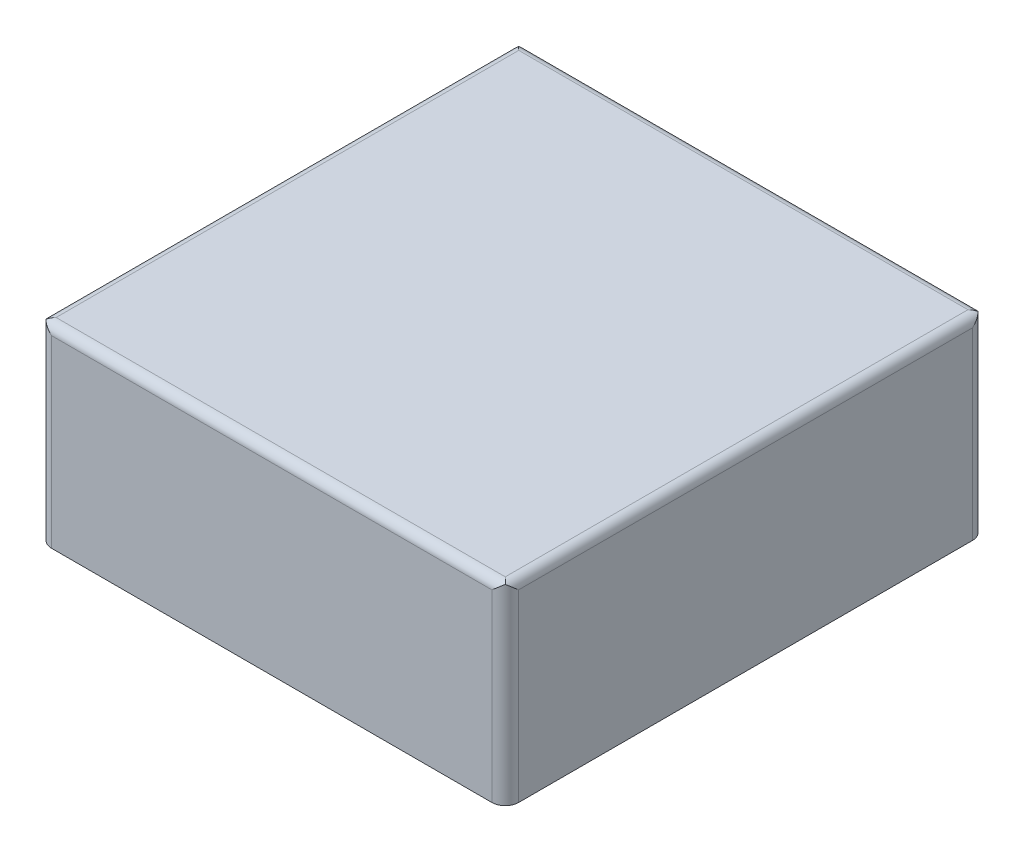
ISO-10303-21;
HEADER;
FILE_DESCRIPTION(('STEP AP214'),'2;1');
FILE_NAME('part.step','',(''),(''),'','','');
FILE_SCHEMA(('AUTOMOTIVE_DESIGN { 1 0 10303 214 1 1 1 1 }'));
ENDSEC;
DATA;
#1=APPLICATION_CONTEXT('core data for automotive mechanical design processes');
#2=APPLICATION_PROTOCOL_DEFINITION('international standard','automotive_design',2000,#1);
#3=PRODUCT_CONTEXT('',#1,'mechanical');
#4=PRODUCT('Part','Part','',(#3));
#5=PRODUCT_RELATED_PRODUCT_CATEGORY('part','',(#4));
#6=PRODUCT_DEFINITION_FORMATION('','',#4);
#7=PRODUCT_DEFINITION_CONTEXT('part definition',#1,'design');
#8=PRODUCT_DEFINITION('design','',#6,#7);
#9=PRODUCT_DEFINITION_SHAPE('','',#8);
#10=(LENGTH_UNIT() NAMED_UNIT(*) SI_UNIT(.MILLI.,.METRE.));
#11=(NAMED_UNIT(*) PLANE_ANGLE_UNIT() SI_UNIT($,.RADIAN.));
#12=(NAMED_UNIT(*) SI_UNIT($,.STERADIAN.) SOLID_ANGLE_UNIT());
#13=UNCERTAINTY_MEASURE_WITH_UNIT(LENGTH_MEASURE(1.E-05),#10,'distance_accuracy_value','');
#14=(GEOMETRIC_REPRESENTATION_CONTEXT(3) GLOBAL_UNCERTAINTY_ASSIGNED_CONTEXT((#13)) GLOBAL_UNIT_ASSIGNED_CONTEXT((#10,
#11,#12)) REPRESENTATION_CONTEXT('',''));
#15=CARTESIAN_POINT('',(0.,0.,0.));
#16=DIRECTION('',(0.,0.,1.));
#17=DIRECTION('',(1.,0.,0.));
#18=AXIS2_PLACEMENT_3D('',#15,#16,#17);
#19=CARTESIAN_POINT('',(611.,-109.,-14.4));
#20=DIRECTION('',(0.,-1.,0.));
#21=DIRECTION('',(0.,0.,-1.));
#22=AXIS2_PLACEMENT_3D('',#19,#20,#21);
#23=PLANE('',#22);
#24=DIRECTION('',(0.,0.,-1.));
#25=VECTOR('',#24,1.);
#26=CARTESIAN_POINT('',(561.,-109.,39.1));
#27=LINE('',#26,#25);
#28=CARTESIAN_POINT('',(561.,-109.,-65.9));
#29=VERTEX_POINT('',#28);
#30=CARTESIAN_POINT('',(561.,-108.999999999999,37.1));
#31=VERTEX_POINT('',#30);
#32=EDGE_CURVE('E135',#29,#31,#27,.F.);
#33=ORIENTED_EDGE('',*,*,#32,.T.);
#34=DIRECTION('',(-1.,0.,0.));
#35=VECTOR('',#34,1.);
#36=CARTESIAN_POINT('',(663.,-109.,37.0999999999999));
#37=LINE('',#36,#35);
#38=CARTESIAN_POINT('',(661.,-109.,37.0999999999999));
#39=VERTEX_POINT('',#38);
#40=EDGE_CURVE('E225',#31,#39,#37,.F.);
#41=ORIENTED_EDGE('',*,*,#40,.T.);
#42=DIRECTION('',(0.,0.,-1.));
#43=VECTOR('',#42,1.);
#44=CARTESIAN_POINT('',(661.,-109.,39.0999999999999));
#45=LINE('',#44,#43);
#46=CARTESIAN_POINT('',(661.,-109.,-65.9));
#47=VERTEX_POINT('',#46);
#48=EDGE_CURVE('E138',#39,#47,#45,.T.);
#49=ORIENTED_EDGE('',*,*,#48,.T.);
#50=DIRECTION('',(-1.,0.,0.));
#51=VECTOR('',#50,1.);
#52=CARTESIAN_POINT('',(663.,-109.,-65.9));
#53=LINE('',#52,#51);
#54=EDGE_CURVE('E133',#47,#29,#53,.T.);
#55=ORIENTED_EDGE('',*,*,#54,.T.);
#56=EDGE_LOOP('',(#33,#41,#49,#55));
#57=FACE_BOUND('',#56,.T.);
#58=ADVANCED_FACE('F16',(#57),#23,.F.);
#59=CARTESIAN_POINT('',(561.,-111.,38.8527761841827));
#60=DIRECTION('',(0.,0.,-1.));
#61=DIRECTION('',(-1.,0.,0.));
#62=AXIS2_PLACEMENT_3D('',#59,#60,#61);
#63=CYLINDRICAL_SURFACE('',#62,2.);
#64=CARTESIAN_POINT('',(559.,-111.,-64.9));
#65=CARTESIAN_POINT('',(559.000002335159,-110.938544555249,-64.9753303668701));
#66=CARTESIAN_POINT('',(559.002836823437,-110.877098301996,-65.0506711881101));
#67=CARTESIAN_POINT('',(559.013154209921,-110.765713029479,-65.1873102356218));
#68=CARTESIAN_POINT('',(559.019688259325,-110.715732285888,-65.2486473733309));
#69=CARTESIAN_POINT('',(559.034666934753,-110.627269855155,-65.3572680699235));
#70=CARTESIAN_POINT('',(559.042351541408,-110.588729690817,-65.4046102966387));
#71=CARTESIAN_POINT('',(559.064031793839,-110.494711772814,-65.5204448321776));
#72=CARTESIAN_POINT('',(559.07931098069,-110.439425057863,-65.5888575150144));
#73=CARTESIAN_POINT('',(559.113419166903,-110.334026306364,-65.7196673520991));
#74=CARTESIAN_POINT('',(559.131871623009,-110.283850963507,-65.7821121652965));
#75=CARTESIAN_POINT('',(559.171297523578,-110.188700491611,-65.9010101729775));
#76=CARTESIAN_POINT('',(559.191919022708,-110.143648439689,-65.9575179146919));
#77=CARTESIAN_POINT('',(559.228129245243,-110.071891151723,-66.0480865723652));
#78=CARTESIAN_POINT('',(559.242564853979,-110.04485177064,-66.0823472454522));
#79=CARTESIAN_POINT('',(559.272461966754,-109.991886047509,-66.1497444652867));
#80=CARTESIAN_POINT('',(559.287888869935,-109.965948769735,-66.1828877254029));
#81=CARTESIAN_POINT('',(559.319684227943,-109.915185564,-66.2480309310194));
#82=CARTESIAN_POINT('',(559.33601871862,-109.890348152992,-66.2800385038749));
#83=CARTESIAN_POINT('',(559.369548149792,-109.84178588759,-66.3428994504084));
#84=CARTESIAN_POINT('',(559.386709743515,-109.818048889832,-66.373761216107));
#85=CARTESIAN_POINT('',(559.421813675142,-109.771687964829,-66.4343231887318));
#86=CARTESIAN_POINT('',(559.439723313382,-109.749051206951,-66.4640325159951));
#87=CARTESIAN_POINT('',(559.47624571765,-109.704891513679,-66.5222866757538));
#88=CARTESIAN_POINT('',(559.494826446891,-109.683355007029,-66.5508412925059));
#89=CARTESIAN_POINT('',(559.532615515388,-109.641396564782,-66.6067869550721));
#90=CARTESIAN_POINT('',(559.551792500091,-109.620960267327,-66.6341883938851));
#91=CARTESIAN_POINT('',(559.59070081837,-109.58120307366,-66.6878322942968));
#92=CARTESIAN_POINT('',(559.610401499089,-109.561866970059,-66.7140857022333));
#93=CARTESIAN_POINT('',(559.65028629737,-109.524310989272,-66.7654415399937));
#94=CARTESIAN_POINT('',(559.670440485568,-109.506075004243,-66.7905554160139));
#95=CARTESIAN_POINT('',(559.711163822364,-109.470720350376,-66.8396432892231));
#96=CARTESIAN_POINT('',(559.731703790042,-109.453584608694,-66.8636291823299));
#97=CARTESIAN_POINT('',(559.773132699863,-109.420430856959,-66.910475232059));
#98=CARTESIAN_POINT('',(559.79399323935,-109.404394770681,-66.93334768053));
#99=CARTESIAN_POINT('',(559.835999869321,-109.373443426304,-66.9779830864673));
#100=CARTESIAN_POINT('',(559.857118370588,-109.358508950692,-66.9997587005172));
#101=CARTESIAN_POINT('',(559.87867965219,-109.343908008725,-67.0213203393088));
#102=B_SPLINE_CURVE_WITH_KNOTS('',3,(#64,#65,#66,#67,#68,#69,#70,#71,#72,#73,#74,#75,#76,#77,
#78,#79,#80,#81,#82,#83,#84,#85,#86,#87,#88,#89,#90,#91,#92,#93,#94,#95,#96,#97,#98,#99,#100,
#101),.UNSPECIFIED.,.F.,.F.,(4,2,2,2,2,2,2,2,2,2,2,2,2,2,2,2,2,2,4),(0.,0.291614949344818,
0.529696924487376,0.714242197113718,0.981921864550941,1.22842115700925,1.45377929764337,
1.59166995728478,1.72611877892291,1.85714512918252,1.98476993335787,2.10901583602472,
2.22990738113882,2.34747121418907,2.46173630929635,2.57273422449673,2.68049938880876,
2.78506942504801,2.88648551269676),.UNSPECIFIED.);
#103=CARTESIAN_POINT('',(559.,-111.,-64.9));
#104=VERTEX_POINT('',#103);
#105=CARTESIAN_POINT('',(559.878679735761,-109.343907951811,-67.0213202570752));
#106=VERTEX_POINT('',#105);
#107=EDGE_CURVE('E485',#104,#106,#102,.T.);
#108=ORIENTED_EDGE('',*,*,#107,.F.);
#109=DIRECTION('',(0.,0.,1.));
#110=VECTOR('',#109,1.);
#111=CARTESIAN_POINT('',(559.,-111.,-15.9));
#112=LINE('',#111,#110);
#113=CARTESIAN_POINT('',(559.,-111.,36.1));
#114=VERTEX_POINT('',#113);
#115=EDGE_CURVE('E409',#114,#104,#112,.F.);
#116=ORIENTED_EDGE('',*,*,#115,.F.);
#117=CARTESIAN_POINT('',(559.87867965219,-109.343908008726,38.2213203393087));
#118=CARTESIAN_POINT('',(559.857119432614,-109.358508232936,38.1997597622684));
#119=CARTESIAN_POINT('',(559.8360019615,-109.373441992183,38.1779852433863));
#120=CARTESIAN_POINT('',(559.793997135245,-109.404392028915,38.1333518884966));
#121=CARTESIAN_POINT('',(559.773137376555,-109.420427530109,38.1104803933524));
#122=CARTESIAN_POINT('',(559.731709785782,-109.453580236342,38.0636360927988));
#123=CARTESIAN_POINT('',(559.711170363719,-109.470715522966,38.0396509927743));
#124=CARTESIAN_POINT('',(559.670447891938,-109.50606939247,37.990564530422));
#125=CARTESIAN_POINT('',(559.650294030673,-109.524305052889,37.9654512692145));
#126=CARTESIAN_POINT('',(559.610409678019,-109.561860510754,37.9140964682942));
#127=CARTESIAN_POINT('',(559.590709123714,-109.581196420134,37.8878434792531));
#128=CARTESIAN_POINT('',(559.551800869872,-109.620953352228,37.8342002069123));
#129=CARTESIAN_POINT('',(559.532623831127,-109.641389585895,37.8067989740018));
#130=CARTESIAN_POINT('',(559.494834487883,-109.683348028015,37.7508534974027));
#131=CARTESIAN_POINT('',(559.476253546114,-109.704884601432,37.7222988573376));
#132=CARTESIAN_POINT('',(559.439730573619,-109.749044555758,37.6640444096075));
#133=CARTESIAN_POINT('',(559.421820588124,-109.771681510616,37.6343348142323));
#134=CARTESIAN_POINT('',(559.386715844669,-109.818042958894,37.5737720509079));
#135=CARTESIAN_POINT('',(559.369553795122,-109.841780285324,37.5429097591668));
#136=CARTESIAN_POINT('',(559.33602336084,-109.890343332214,37.4800474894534));
#137=CARTESIAN_POINT('',(559.319688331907,-109.915181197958,37.4480391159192));
#138=CARTESIAN_POINT('',(559.287891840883,-109.965945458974,37.3828940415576));
#139=CARTESIAN_POINT('',(559.272464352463,-109.991883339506,37.349749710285));
#140=CARTESIAN_POINT('',(559.24256602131,-110.044850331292,37.2823500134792));
#141=CARTESIAN_POINT('',(559.228129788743,-110.071890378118,37.2480879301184));
#142=CARTESIAN_POINT('',(559.191923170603,-110.143639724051,37.1575282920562));
#143=CARTESIAN_POINT('',(559.171305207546,-110.188683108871,37.1010312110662));
#144=CARTESIAN_POINT('',(559.1318814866,-110.283824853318,36.9821442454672));
#145=CARTESIAN_POINT('',(559.1134283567,-110.334000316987,36.9196997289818));
#146=CARTESIAN_POINT('',(559.079315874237,-110.439407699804,36.788879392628));
#147=CARTESIAN_POINT('',(559.064033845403,-110.494703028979,36.72045578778));
#148=CARTESIAN_POINT('',(559.042352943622,-110.588723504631,36.604617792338));
#149=CARTESIAN_POINT('',(559.034669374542,-110.627257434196,36.5572830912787));
#150=CARTESIAN_POINT('',(559.019690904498,-110.71571359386,36.4486699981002));
#151=CARTESIAN_POINT('',(559.01315639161,-110.765694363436,36.3873329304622));
#152=CARTESIAN_POINT('',(559.002837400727,-110.877085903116,36.2506864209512));
#153=CARTESIAN_POINT('',(559.000002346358,-110.938538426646,36.1753380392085));
#154=CARTESIAN_POINT('',(559.,-111.,36.1));
#155=B_SPLINE_CURVE_WITH_KNOTS('',3,(#117,#118,#119,#120,#121,#122,#123,#124,#125,#126,#127,
#128,#129,#130,#131,#132,#133,#134,#135,#136,#137,#138,#139,#140,#141,#142,#143,#144,#145,#146,
#147,#148,#149,#150,#151,#152,#153,#154),.UNSPECIFIED.,.F.,.F.,(4,2,2,2,2,2,2,2,2,2,2,2,2,2,2,2,
2,2,4),(0.,0.101411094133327,0.205977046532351,0.313739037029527,0.424734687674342,
0.538998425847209,0.656561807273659,0.777453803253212,0.901701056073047,1.02932810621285,
1.16035759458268,1.29481044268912,1.43270601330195,1.65802165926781,1.90452095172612,
2.1722431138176,2.35675893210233,2.59484090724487,2.88648530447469),.UNSPECIFIED.);
#156=CARTESIAN_POINT('',(559.878679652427,-109.343908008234,38.2213203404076));
#157=VERTEX_POINT('',#156);
#158=EDGE_CURVE('E410',#157,#114,#155,.T.);
#159=ORIENTED_EDGE('',*,*,#158,.F.);
#160=CARTESIAN_POINT('',(559.878679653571,-109.343908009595,38.2213203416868));
#161=CARTESIAN_POINT('',(559.903850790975,-109.326866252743,38.1961460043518));
#162=CARTESIAN_POINT('',(559.929244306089,-109.310508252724,38.1707346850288));
#163=CARTESIAN_POINT('',(559.981728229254,-109.278338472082,38.118206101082));
#164=CARTESIAN_POINT('',(560.008839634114,-109.262595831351,38.0910674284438));
#165=CARTESIAN_POINT('',(560.064781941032,-109.231827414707,38.0350855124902));
#166=CARTESIAN_POINT('',(560.093632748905,-109.216872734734,38.0062231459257));
#167=CARTESIAN_POINT('',(560.153062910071,-109.187862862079,37.9467899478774));
#168=CARTESIAN_POINT('',(560.183660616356,-109.173880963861,37.9162017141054));
#169=CARTESIAN_POINT('',(560.246583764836,-109.147006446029,37.8533191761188));
#170=CARTESIAN_POINT('',(560.278925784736,-109.134189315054,37.8210092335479));
#171=CARTESIAN_POINT('',(560.345305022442,-109.109847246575,37.7546665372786));
#172=CARTESIAN_POINT('',(560.379355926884,-109.098400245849,37.7206188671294));
#173=CARTESIAN_POINT('',(560.440438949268,-109.079666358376,37.6595808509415));
#174=CARTESIAN_POINT('',(560.467411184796,-109.072013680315,37.6326419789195));
#175=CARTESIAN_POINT('',(560.521268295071,-109.057943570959,37.5788941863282));
#176=CARTESIAN_POINT('',(560.548151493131,-109.05151491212,37.5520865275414));
#177=CARTESIAN_POINT('',(560.601777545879,-109.03985624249,37.4986063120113));
#178=CARTESIAN_POINT('',(560.628519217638,-109.034615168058,37.4719349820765));
#179=CARTESIAN_POINT('',(560.680272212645,-109.025558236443,37.4201472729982));
#180=CARTESIAN_POINT('',(560.705282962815,-109.021671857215,37.3950425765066));
#181=CARTESIAN_POINT('',(560.768523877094,-109.013067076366,37.3316080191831));
#182=CARTESIAN_POINT('',(560.806809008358,-109.008980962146,37.2932460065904));
#183=CARTESIAN_POINT('',(560.89668929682,-109.002001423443,37.2032636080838));
#184=CARTESIAN_POINT('',(560.948333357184,-109.000001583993,37.151621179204));
#185=CARTESIAN_POINT('',(561.,-109.,37.1));
#186=B_SPLINE_CURVE_WITH_KNOTS('',3,(#160,#161,#162,#163,#164,#165,#166,#167,#168,#169,#170,
#171,#172,#173,#174,#175,#176,#177,#178,#179,#180,#181,#182,#183,#184,#185),.UNSPECIFIED.,.F.,
.F.,(4,2,2,2,2,2,2,2,2,2,2,2,4),(0.,0.11839478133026,0.242759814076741,0.37311752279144,
0.509487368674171,0.651886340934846,0.800329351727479,0.916956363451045,1.0324557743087,
1.14683036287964,1.25376653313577,1.41677553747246,1.6358500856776),.UNSPECIFIED.);
#187=EDGE_CURVE('E150',#157,#31,#186,.T.);
#188=ORIENTED_EDGE('',*,*,#187,.T.);
#189=ORIENTED_EDGE('',*,*,#32,.F.);
#190=CARTESIAN_POINT('',(561.,-109.,-65.9));
#191=CARTESIAN_POINT('',(560.948338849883,-109.000001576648,-65.9516157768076));
#192=CARTESIAN_POINT('',(560.896700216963,-109.002000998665,-66.0032527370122));
#193=CARTESIAN_POINT('',(560.806827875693,-109.008979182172,-66.0932271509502));
#194=CARTESIAN_POINT('',(560.768545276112,-109.013064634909,-66.1315866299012));
#195=CARTESIAN_POINT('',(560.705306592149,-109.021668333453,-66.1950190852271));
#196=CARTESIAN_POINT('',(560.680295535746,-109.025554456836,-66.2201241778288));
#197=CARTESIAN_POINT('',(560.628543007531,-109.034610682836,-66.2719116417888));
#198=CARTESIAN_POINT('',(560.601802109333,-109.039851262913,-66.2985823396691));
#199=CARTESIAN_POINT('',(560.548174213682,-109.051509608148,-66.3520644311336));
#200=CARTESIAN_POINT('',(560.521288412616,-109.057938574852,-66.3788745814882));
#201=CARTESIAN_POINT('',(560.467422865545,-109.072010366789,-66.4326305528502));
#202=CARTESIAN_POINT('',(560.440444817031,-109.079664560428,-66.4595750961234));
#203=CARTESIAN_POINT('',(560.379355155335,-109.098400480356,-66.5206194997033));
#204=CARTESIAN_POINT('',(560.345303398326,-109.109847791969,-66.5546679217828));
#205=CARTESIAN_POINT('',(560.278922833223,-109.134190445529,-66.6210118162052));
#206=CARTESIAN_POINT('',(560.246580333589,-109.147007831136,-66.6533222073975));
#207=CARTESIAN_POINT('',(560.183656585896,-109.173882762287,-66.7162053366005));
#208=CARTESIAN_POINT('',(560.153058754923,-109.187864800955,-66.7467937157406));
#209=CARTESIAN_POINT('',(560.093628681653,-109.216874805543,-66.8062268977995));
#210=CARTESIAN_POINT('',(560.064778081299,-109.231829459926,-66.8350891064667));
#211=CARTESIAN_POINT('',(560.00883650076,-109.26259762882,-66.8910703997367));
#212=CARTESIAN_POINT('',(559.981725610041,-109.278340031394,-66.9182086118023));
#213=CARTESIAN_POINT('',(559.929242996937,-109.310509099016,-66.9707359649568));
#214=CARTESIAN_POINT('',(559.903850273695,-109.32686660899,-66.9961465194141));
#215=CARTESIAN_POINT('',(559.87867990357,-109.343907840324,-67.0213200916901));
#216=B_SPLINE_CURVE_WITH_KNOTS('',3,(#190,#191,#192,#193,#194,#195,#196,#197,#198,#199,#200,
#201,#202,#203,#204,#205,#206,#207,#208,#209,#210,#211,#212,#213,#214,#215),.UNSPECIFIED.,.F.,
.F.,(4,2,2,2,2,2,2,2,2,2,2,2,4),(0.,0.219051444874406,0.382049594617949,0.488987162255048,
0.603358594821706,0.718868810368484,0.835520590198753,0.983967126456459,1.12636819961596,
1.26273871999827,1.39309567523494,1.51745852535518,1.63584969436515),.UNSPECIFIED.);
#217=EDGE_CURVE('E142',#29,#106,#216,.T.);
#218=ORIENTED_EDGE('',*,*,#217,.T.);
#219=EDGE_LOOP('',(#108,#116,#159,#188,#189,#218));
#220=FACE_BOUND('',#219,.T.);
#221=ADVANCED_FACE('F146',(#220),#63,.T.);
#222=CARTESIAN_POINT('',(633.,-130.,-67.9000000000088));
#223=DIRECTION('',(0.,0.,-1.));
#224=DIRECTION('',(-1.,0.,0.));
#225=AXIS2_PLACEMENT_3D('',#222,#223,#224);
#226=CONICAL_SURFACE('',#225,0.999999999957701,0.78539816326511);
#227=CARTESIAN_POINT('',(634.,-130.,-67.9));
#228=CARTESIAN_POINT('',(633.999898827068,-129.809268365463,-67.9));
#229=CARTESIAN_POINT('',(633.929788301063,-129.631905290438,-67.9));
#230=CARTESIAN_POINT('',(633.853846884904,-129.43979144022,-67.9));
#231=CARTESIAN_POINT('',(633.707106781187,-129.292893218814,-67.9));
#232=CARTESIAN_POINT('',(633.561111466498,-129.146740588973,-67.9));
#233=CARTESIAN_POINT('',(633.368094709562,-129.070211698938,-67.9));
#234=CARTESIAN_POINT('',(633.191266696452,-129.000101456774,-67.9));
#235=CARTESIAN_POINT('',(633.,-129.,-67.9));
#236=CARTESIAN_POINT('',(632.809779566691,-128.999899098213,-67.9));
#237=CARTESIAN_POINT('',(632.631905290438,-129.070211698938,-67.9));
#238=CARTESIAN_POINT('',(632.43979144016,-129.146153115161,-67.9));
#239=CARTESIAN_POINT('',(632.292893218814,-129.292893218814,-67.9));
#240=CARTESIAN_POINT('',(632.146740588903,-129.438888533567,-67.9));
#241=CARTESIAN_POINT('',(632.070211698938,-129.631905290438,-67.9));
#242=CARTESIAN_POINT('',(632.000101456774,-129.808733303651,-67.9));
#243=CARTESIAN_POINT('',(632.,-130.,-67.9));
#244=B_SPLINE_CURVE_WITH_KNOTS('',2,(#227,#228,#229,#230,#231,#232,#233,#234,#235,#236,#237,
#238,#239,#240,#241,#242,#243),.UNSPECIFIED.,.F.,.F.,(3,2,2,2,2,2,2,2,3),(0.,0.125,0.25,0.375,
0.5,0.625,0.75,0.875,1.),.UNSPECIFIED.);
#245=CARTESIAN_POINT('',(633.999999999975,-130.,-67.9000000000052));
#246=VERTEX_POINT('',#245);
#247=CARTESIAN_POINT('',(632.00000000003,-130.,-67.9000000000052));
#248=VERTEX_POINT('',#247);
#249=EDGE_CURVE('E481',#246,#248,#244,.T.);
#250=ORIENTED_EDGE('',*,*,#249,.F.);
#251=CARTESIAN_POINT('',(632.,-130.,-67.9));
#252=CARTESIAN_POINT('',(632.000101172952,-130.190731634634,-67.9));
#253=CARTESIAN_POINT('',(632.070211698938,-130.368094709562,-67.9));
#254=CARTESIAN_POINT('',(632.146153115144,-130.560208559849,-67.9));
#255=CARTESIAN_POINT('',(632.292893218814,-130.707106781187,-67.9));
#256=CARTESIAN_POINT('',(632.438888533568,-130.853259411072,-67.9));
#257=CARTESIAN_POINT('',(632.631905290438,-130.929788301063,-67.9));
#258=CARTESIAN_POINT('',(632.808733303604,-130.999898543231,-67.9));
#259=CARTESIAN_POINT('',(633.,-131.,-67.9));
#260=CARTESIAN_POINT('',(633.190220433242,-131.000100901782,-67.9));
#261=CARTESIAN_POINT('',(633.368094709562,-130.929788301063,-67.9));
#262=CARTESIAN_POINT('',(633.560208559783,-130.853846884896,-67.9));
#263=CARTESIAN_POINT('',(633.707106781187,-130.707106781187,-67.9));
#264=CARTESIAN_POINT('',(633.853259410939,-130.561111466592,-67.9));
#265=CARTESIAN_POINT('',(633.929788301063,-130.368094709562,-67.9));
#266=CARTESIAN_POINT('',(633.999898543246,-130.191266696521,-67.9));
#267=CARTESIAN_POINT('',(634.,-130.,-67.9));
#268=B_SPLINE_CURVE_WITH_KNOTS('',2,(#251,#252,#253,#254,#255,#256,#257,#258,#259,#260,#261,
#262,#263,#264,#265,#266,#267),.UNSPECIFIED.,.F.,.F.,(3,2,2,2,2,2,2,2,3),(0.,0.125,0.25,0.375,
0.5,0.625,0.75,0.875,1.),.UNSPECIFIED.);
#269=EDGE_CURVE('E483',#248,#246,#268,.T.);
#270=ORIENTED_EDGE('',*,*,#269,.F.);
#271=EDGE_LOOP('',(#250,#270));
#272=FACE_BOUND('',#271,.T.);
#273=CARTESIAN_POINT('',(633.00000000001,-130.,-66.9000000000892));
#274=VERTEX_POINT('',#273);
#275=VERTEX_LOOP('',#274);
#276=FACE_BOUND('',#275,.T.);
#277=ADVANCED_FACE('F251',(#272,#276),#226,.F.);
#278=CARTESIAN_POINT('',(589.,-130.,-67.9000000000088));
#279=DIRECTION('',(0.,0.,-1.));
#280=DIRECTION('',(-1.,0.,0.));
#281=AXIS2_PLACEMENT_3D('',#278,#279,#280);
#282=CONICAL_SURFACE('',#281,1.00000000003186,0.785398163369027);
#283=CARTESIAN_POINT('',(590.,-130.,-67.9));
#284=CARTESIAN_POINT('',(589.999898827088,-129.809268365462,-67.9));
#285=CARTESIAN_POINT('',(589.929788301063,-129.631905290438,-67.9));
#286=CARTESIAN_POINT('',(589.853846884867,-129.439791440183,-67.9));
#287=CARTESIAN_POINT('',(589.707106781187,-129.292893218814,-67.9));
#288=CARTESIAN_POINT('',(589.561111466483,-129.146740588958,-67.9));
#289=CARTESIAN_POINT('',(589.368094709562,-129.070211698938,-67.9));
#290=CARTESIAN_POINT('',(589.191266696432,-129.000101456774,-67.9));
#291=CARTESIAN_POINT('',(589.,-129.,-67.9));
#292=CARTESIAN_POINT('',(588.80977956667,-128.999899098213,-67.9));
#293=CARTESIAN_POINT('',(588.631905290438,-129.070211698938,-67.9));
#294=CARTESIAN_POINT('',(588.439791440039,-129.146153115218,-67.9));
#295=CARTESIAN_POINT('',(588.292893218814,-129.292893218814,-67.9));
#296=CARTESIAN_POINT('',(588.146740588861,-129.438888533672,-67.9));
#297=CARTESIAN_POINT('',(588.070211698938,-129.631905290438,-67.9));
#298=CARTESIAN_POINT('',(588.000101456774,-129.808733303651,-67.9));
#299=CARTESIAN_POINT('',(588.,-130.,-67.9));
#300=B_SPLINE_CURVE_WITH_KNOTS('',2,(#283,#284,#285,#286,#287,#288,#289,#290,#291,#292,#293,
#294,#295,#296,#297,#298,#299),.UNSPECIFIED.,.F.,.F.,(3,2,2,2,2,2,2,2,3),(0.,0.125,0.25,0.375,
0.5,0.625,0.75,0.875,1.),.UNSPECIFIED.);
#301=CARTESIAN_POINT('',(590.000000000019,-130.,-67.9000000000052));
#302=VERTEX_POINT('',#301);
#303=CARTESIAN_POINT('',(587.999999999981,-130.,-67.9000000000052));
#304=VERTEX_POINT('',#303);
#305=EDGE_CURVE('E403',#302,#304,#300,.T.);
#306=ORIENTED_EDGE('',*,*,#305,.F.);
#307=CARTESIAN_POINT('',(588.,-130.,-67.9));
#308=CARTESIAN_POINT('',(588.000101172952,-130.190731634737,-67.9));
#309=CARTESIAN_POINT('',(588.070211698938,-130.368094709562,-67.9));
#310=CARTESIAN_POINT('',(588.146153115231,-130.560208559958,-67.9));
#311=CARTESIAN_POINT('',(588.292893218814,-130.707106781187,-67.9));
#312=CARTESIAN_POINT('',(588.438888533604,-130.853259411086,-67.9));
#313=CARTESIAN_POINT('',(588.631905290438,-130.929788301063,-67.9));
#314=CARTESIAN_POINT('',(588.808733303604,-130.999898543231,-67.9));
#315=CARTESIAN_POINT('',(589.,-131.,-67.9));
#316=CARTESIAN_POINT('',(589.190220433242,-131.000100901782,-67.9));
#317=CARTESIAN_POINT('',(589.368094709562,-130.929788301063,-67.9));
#318=CARTESIAN_POINT('',(589.560208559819,-130.853846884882,-67.9));
#319=CARTESIAN_POINT('',(589.707106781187,-130.707106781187,-67.9));
#320=CARTESIAN_POINT('',(589.85325941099,-130.56111146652,-67.9));
#321=CARTESIAN_POINT('',(589.929788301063,-130.368094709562,-67.9));
#322=CARTESIAN_POINT('',(589.999898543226,-130.19126669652,-67.9));
#323=CARTESIAN_POINT('',(590.,-130.,-67.9));
#324=B_SPLINE_CURVE_WITH_KNOTS('',2,(#307,#308,#309,#310,#311,#312,#313,#314,#315,#316,#317,
#318,#319,#320,#321,#322,#323),.UNSPECIFIED.,.F.,.F.,(3,2,2,2,2,2,2,2,3),(0.,0.125,0.25,0.375,
0.5,0.625,0.75,0.875,1.),.UNSPECIFIED.);
#325=EDGE_CURVE('E479',#304,#302,#324,.T.);
#326=ORIENTED_EDGE('',*,*,#325,.F.);
#327=EDGE_LOOP('',(#306,#326));
#328=FACE_BOUND('',#327,.T.);
#329=CARTESIAN_POINT('',(588.999999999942,-130.,-66.8999999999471));
#330=VERTEX_POINT('',#329);
#331=VERTEX_LOOP('',#330);
#332=FACE_BOUND('',#331,.T.);
#333=ADVANCED_FACE('F180',(#328,#332),#282,.F.);
#334=CARTESIAN_POINT('',(662.734776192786,-111.,-65.9000000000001));
#335=DIRECTION('',(-1.,0.,0.));
#336=DIRECTION('',(0.,0.,1.));
#337=AXIS2_PLACEMENT_3D('',#334,#335,#336);
#338=CYLINDRICAL_SURFACE('',#337,2.);
#339=DIRECTION('',(-1.,0.,0.));
#340=VECTOR('',#339,1.);
#341=CARTESIAN_POINT('',(660.,-111.,-67.9));
#342=LINE('',#341,#340);
#343=CARTESIAN_POINT('',(562.,-111.,-67.9000000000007));
#344=VERTEX_POINT('',#343);
#345=CARTESIAN_POINT('',(660.,-111.,-67.9000000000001));
#346=VERTEX_POINT('',#345);
#347=EDGE_CURVE('E306',#344,#346,#342,.F.);
#348=ORIENTED_EDGE('',*,*,#347,.F.);
#349=CARTESIAN_POINT('',(559.87867965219,-109.343908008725,-67.0213203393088));
#350=CARTESIAN_POINT('',(559.900240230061,-109.358508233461,-67.0428805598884));
#351=CARTESIAN_POINT('',(559.922014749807,-109.373441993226,-67.0639980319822));
#352=CARTESIAN_POINT('',(559.96664810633,-109.404392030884,-67.1060028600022));
#353=CARTESIAN_POINT('',(559.989519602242,-109.420427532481,-67.1268626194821));
#354=CARTESIAN_POINT('',(560.036363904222,-109.453580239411,-67.1682902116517));
#355=CARTESIAN_POINT('',(560.060349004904,-109.470715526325,-67.1888296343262));
#356=CARTESIAN_POINT('',(560.10943546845,-109.506069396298,-67.2295521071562));
#357=CARTESIAN_POINT('',(560.134548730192,-109.524305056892,-67.2497059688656));
#358=CARTESIAN_POINT('',(560.185903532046,-109.561860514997,-67.2895903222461));
#359=CARTESIAN_POINT('',(560.212156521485,-109.581196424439,-67.3092908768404));
#360=CARTESIAN_POINT('',(560.265799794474,-109.620953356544,-67.3481991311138));
#361=CARTESIAN_POINT('',(560.293201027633,-109.641389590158,-67.3673761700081));
#362=CARTESIAN_POINT('',(560.34914650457,-109.683348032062,-67.4051655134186));
#363=CARTESIAN_POINT('',(560.377701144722,-109.704884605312,-67.423746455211));
#364=CARTESIAN_POINT('',(560.435955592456,-109.749044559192,-67.4602694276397));
#365=CARTESIAN_POINT('',(560.465665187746,-109.771681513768,-67.478179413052));
#366=CARTESIAN_POINT('',(560.526227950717,-109.818042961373,-67.5132841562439));
#367=CARTESIAN_POINT('',(560.557090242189,-109.841780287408,-67.530446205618));
#368=CARTESIAN_POINT('',(560.619952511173,-109.890343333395,-67.5639766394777));
#369=CARTESIAN_POINT('',(560.651960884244,-109.91518119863,-67.5803116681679));
#370=CARTESIAN_POINT('',(560.717105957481,-109.965945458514,-67.6121081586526));
#371=CARTESIAN_POINT('',(560.75025028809,-109.991883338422,-67.6275356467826));
#372=CARTESIAN_POINT('',(560.817649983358,-110.044850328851,-67.6574339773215));
#373=CARTESIAN_POINT('',(560.851912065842,-110.071890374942,-67.6718702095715));
#374=CARTESIAN_POINT('',(560.942471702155,-110.143639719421,-67.7080768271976));
#375=CARTESIAN_POINT('',(560.998968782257,-110.188683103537,-67.7286947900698));
#376=CARTESIAN_POINT('',(561.117855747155,-110.283824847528,-67.7681185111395));
#377=CARTESIAN_POINT('',(561.180300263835,-110.334000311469,-67.7865716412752));
#378=CARTESIAN_POINT('',(561.311120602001,-110.439407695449,-67.8206841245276));
#379=CARTESIAN_POINT('',(561.379544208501,-110.494703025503,-67.8359661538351));
#380=CARTESIAN_POINT('',(561.49538214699,-110.588723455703,-67.8576470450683));
#381=CARTESIAN_POINT('',(561.542716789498,-110.627257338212,-67.8653306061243));
#382=CARTESIAN_POINT('',(561.651329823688,-110.715713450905,-67.8803090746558));
#383=CARTESIAN_POINT('',(561.712666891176,-110.765694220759,-67.8868435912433));
#384=CARTESIAN_POINT('',(561.84931345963,-110.877085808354,-67.8971625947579));
#385=CARTESIAN_POINT('',(561.924661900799,-110.938538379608,-67.8999976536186));
#386=CARTESIAN_POINT('',(562.,-111.,-67.9));
#387=B_SPLINE_CURVE_WITH_KNOTS('',3,(#349,#350,#351,#352,#353,#354,#355,#356,#357,#358,#359,
#360,#361,#362,#363,#364,#365,#366,#367,#368,#369,#370,#371,#372,#373,#374,#375,#376,#377,#378,
#379,#380,#381,#382,#383,#384,#385,#386),.UNSPECIFIED.,.F.,.F.,(4,2,2,2,2,2,2,2,2,2,2,2,2,2,2,2,
2,2,4),(0.,0.101411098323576,0.205977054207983,0.31373904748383,0.424734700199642,
0.53899843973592,0.656561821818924,0.777453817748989,0.901701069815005,1.02932811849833,
1.16035760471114,1.29481044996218,1.43270601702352,1.65802165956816,1.90452095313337,
2.17224312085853,2.35675871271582,2.59484068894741,2.88648531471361),.UNSPECIFIED.);
#388=EDGE_CURVE('E157',#106,#344,#387,.T.);
#389=ORIENTED_EDGE('',*,*,#388,.F.);
#390=ORIENTED_EDGE('',*,*,#217,.F.);
#391=ORIENTED_EDGE('',*,*,#54,.F.);
#392=CARTESIAN_POINT('',(661.,-109.,-65.9000000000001));
#393=CARTESIAN_POINT('',(661.051615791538,-109.000001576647,-65.9516611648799));
#394=CARTESIAN_POINT('',(661.103252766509,-109.002000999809,-66.0032998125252));
#395=CARTESIAN_POINT('',(661.19322720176,-109.008979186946,-66.0931721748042));
#396=CARTESIAN_POINT('',(661.231586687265,-109.013064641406,-66.1314547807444));
#397=CARTESIAN_POINT('',(661.295019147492,-109.021668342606,-66.1946934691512));
#398=CARTESIAN_POINT('',(661.320124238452,-109.025554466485,-66.2197045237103));
#399=CARTESIAN_POINT('',(661.371911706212,-109.034610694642,-66.27145705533));
#400=CARTESIAN_POINT('',(661.398582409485,-109.039851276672,-66.298197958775));
#401=CARTESIAN_POINT('',(661.452064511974,-109.051509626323,-66.351825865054));
#402=CARTESIAN_POINT('',(661.47887466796,-109.057938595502,-66.3787116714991));
#403=CARTESIAN_POINT('',(661.532630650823,-109.072010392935,-66.4325772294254));
#404=CARTESIAN_POINT('',(661.559575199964,-109.079664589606,-66.459555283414));
#405=CARTESIAN_POINT('',(661.620619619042,-109.098400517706,-66.5206449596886));
#406=CARTESIAN_POINT('',(661.654668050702,-109.109847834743,-66.5546967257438));
#407=CARTESIAN_POINT('',(661.721011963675,-109.13419050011,-66.6210773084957));
#408=CARTESIAN_POINT('',(661.753322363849,-109.147007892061,-66.6534198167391));
#409=CARTESIAN_POINT('',(661.816205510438,-109.173882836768,-66.7163435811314));
#410=CARTESIAN_POINT('',(661.846793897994,-109.187864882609,-66.7469414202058));
#411=CARTESIAN_POINT('',(661.906227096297,-109.216874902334,-66.8063715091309));
#412=CARTESIAN_POINT('',(661.935089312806,-109.231829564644,-66.8352221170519));
#413=CARTESIAN_POINT('',(661.991070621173,-109.2625977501,-66.8911637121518));
#414=CARTESIAN_POINT('',(662.018208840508,-109.278340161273,-66.918274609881));
#415=CARTESIAN_POINT('',(662.070736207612,-109.310509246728,-66.9707572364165));
#416=CARTESIAN_POINT('',(662.096146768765,-109.326866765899,-66.9961499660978));
#417=CARTESIAN_POINT('',(662.121320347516,-109.343908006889,-67.0213203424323));
#418=B_SPLINE_CURVE_WITH_KNOTS('',3,(#392,#393,#394,#395,#396,#397,#398,#399,#400,#401,#402,
#403,#404,#405,#406,#407,#408,#409,#410,#411,#412,#413,#414,#415,#416,#417),.UNSPECIFIED.,.F.,
.F.,(4,2,2,2,2,2,2,2,2,2,2,2,4),(0.,0.219051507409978,0.382049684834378,0.488987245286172,
0.60335870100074,0.718868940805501,0.835520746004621,0.983967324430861,1.1263684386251,
1.26273899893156,1.39309599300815,1.51745888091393,1.6358500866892),.UNSPECIFIED.);
#419=CARTESIAN_POINT('',(662.121320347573,-109.343908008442,-67.0213203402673));
#420=VERTEX_POINT('',#419);
#421=EDGE_CURVE('E210',#47,#420,#418,.T.);
#422=ORIENTED_EDGE('',*,*,#421,.T.);
#423=CARTESIAN_POINT('',(660.,-111.,-67.9));
#424=CARTESIAN_POINT('',(660.075330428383,-110.938544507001,-67.8999976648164));
#425=CARTESIAN_POINT('',(660.150671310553,-110.877098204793,-67.8971631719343));
#426=CARTESIAN_POINT('',(660.287310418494,-110.76571288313,-67.8868457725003));
#427=CARTESIAN_POINT('',(660.348647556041,-110.715732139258,-67.8803117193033));
#428=CARTESIAN_POINT('',(660.45726819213,-110.627269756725,-67.8653330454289));
#429=CARTESIAN_POINT('',(660.504610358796,-110.588729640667,-67.8576484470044));
#430=CARTESIAN_POINT('',(660.620444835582,-110.494711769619,-67.8359682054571));
#431=CARTESIAN_POINT('',(660.688857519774,-110.439425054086,-67.8206890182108));
#432=CARTESIAN_POINT('',(660.819667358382,-110.334026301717,-67.7865808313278));
#433=CARTESIAN_POINT('',(660.882112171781,-110.283850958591,-67.7681283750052));
#434=CARTESIAN_POINT('',(661.001010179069,-110.188700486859,-67.7287024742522));
#435=CARTESIAN_POINT('',(661.057517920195,-110.143648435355,-67.7080809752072));
#436=CARTESIAN_POINT('',(661.148086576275,-110.071891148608,-67.6718707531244));
#437=CARTESIAN_POINT('',(661.182347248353,-110.044851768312,-67.6574351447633));
#438=CARTESIAN_POINT('',(661.249744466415,-109.99188604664,-67.6275380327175));
#439=CARTESIAN_POINT('',(661.282887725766,-109.965948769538,-67.6121111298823));
#440=CARTESIAN_POINT('',(661.348030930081,-109.91518556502,-67.5803157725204));
#441=CARTESIAN_POINT('',(661.380038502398,-109.890348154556,-67.5639812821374));
#442=CARTESIAN_POINT('',(661.442899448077,-109.841785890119,-67.5304518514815));
#443=CARTESIAN_POINT('',(661.473761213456,-109.818048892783,-67.5132902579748));
#444=CARTESIAN_POINT('',(661.534323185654,-109.771687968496,-67.4781863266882));
#445=CARTESIAN_POINT('',(661.564032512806,-109.749051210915,-67.4602766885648));
#446=CARTESIAN_POINT('',(661.622286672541,-109.704891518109,-67.423754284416));
#447=CARTESIAN_POINT('',(661.650841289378,-109.683355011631,-67.4051735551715));
#448=CARTESIAN_POINT('',(661.7067869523,-109.641396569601,-67.3673844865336));
#449=CARTESIAN_POINT('',(661.734188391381,-109.620960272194,-67.3482075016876));
#450=CARTESIAN_POINT('',(661.7878322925,-109.581203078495,-67.3092991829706));
#451=CARTESIAN_POINT('',(661.814085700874,-109.561866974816,-67.2895985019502));
#452=CARTESIAN_POINT('',(661.865441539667,-109.524310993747,-67.2497137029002));
#453=CARTESIAN_POINT('',(661.890555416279,-109.506075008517,-67.2295595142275));
#454=CARTESIAN_POINT('',(661.939643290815,-109.470720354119,-67.1888361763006));
#455=CARTESIAN_POINT('',(661.963629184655,-109.453584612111,-67.168296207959));
#456=CARTESIAN_POINT('',(662.010475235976,-109.420430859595,-67.1268672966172));
#457=CARTESIAN_POINT('',(662.033347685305,-109.404394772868,-67.1060067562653));
#458=CARTESIAN_POINT('',(662.07798309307,-109.37344342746,-67.0640001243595));
#459=CARTESIAN_POINT('',(662.099758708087,-109.358508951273,-67.0428816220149));
#460=CARTESIAN_POINT('',(662.12132034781,-109.343908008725,-67.0213203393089));
#461=B_SPLINE_CURVE_WITH_KNOTS('',3,(#423,#424,#425,#426,#427,#428,#429,#430,#431,#432,#433,
#434,#435,#436,#437,#438,#439,#440,#441,#442,#443,#444,#445,#446,#447,#448,#449,#450,#451,#452,
#453,#454,#455,#456,#457,#458,#459,#460),.UNSPECIFIED.,.F.,.F.,(4,2,2,2,2,2,2,2,2,2,2,2,2,2,2,2,
2,2,4),(0.,0.291615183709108,0.529697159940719,0.714242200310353,0.981921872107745,
1.22842116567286,1.45377930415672,1.59166995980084,1.72611877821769,1.85714512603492,
1.98476992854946,2.10901583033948,2.22990737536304,2.34747120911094,2.46173630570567,
2.57273422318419,2.68049939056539,2.78506943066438,2.88648552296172),.UNSPECIFIED.);
#462=EDGE_CURVE('E314',#346,#420,#461,.T.);
#463=ORIENTED_EDGE('',*,*,#462,.F.);
#464=EDGE_LOOP('',(#348,#389,#390,#391,#422,#463));
#465=FACE_BOUND('',#464,.T.);
#466=ADVANCED_FACE('F156',(#465),#338,.T.);
#467=CARTESIAN_POINT('',(661.,-111.,38.8527761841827));
#468=DIRECTION('',(0.,0.,-1.));
#469=DIRECTION('',(-1.,0.,0.));
#470=AXIS2_PLACEMENT_3D('',#467,#468,#469);
#471=CYLINDRICAL_SURFACE('',#470,2.);
#472=ORIENTED_EDGE('',*,*,#48,.F.);
#473=CARTESIAN_POINT('',(661.,-109.,37.0999999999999));
#474=CARTESIAN_POINT('',(661.051661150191,-109.000001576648,37.1516157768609));
#475=CARTESIAN_POINT('',(661.103299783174,-109.002000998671,37.2032527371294));
#476=CARTESIAN_POINT('',(661.193172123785,-109.008979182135,37.2932271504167));
#477=CARTESIAN_POINT('',(661.231454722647,-109.013064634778,37.3315866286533));
#478=CARTESIAN_POINT('',(661.294693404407,-109.021668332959,37.3950190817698));
#479=CARTESIAN_POINT('',(661.319704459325,-109.025554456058,37.4201241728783));
#480=CARTESIAN_POINT('',(661.371456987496,-109.034610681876,37.4719116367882));
#481=CARTESIAN_POINT('',(661.398197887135,-109.039851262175,37.4985823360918));
#482=CARTESIAN_POINT('',(661.451825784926,-109.051509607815,37.552064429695));
#483=CARTESIAN_POINT('',(661.478711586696,-109.057938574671,37.5788745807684));
#484=CARTESIAN_POINT('',(661.532577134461,-109.072010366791,37.6326305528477));
#485=CARTESIAN_POINT('',(661.559555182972,-109.079664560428,37.6595750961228));
#486=CARTESIAN_POINT('',(661.620644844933,-109.098400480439,37.7206194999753));
#487=CARTESIAN_POINT('',(661.65469660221,-109.109847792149,37.7546679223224));
#488=CARTESIAN_POINT('',(661.721077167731,-109.134190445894,37.8210118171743));
#489=CARTESIAN_POINT('',(661.753419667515,-109.147007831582,37.8533222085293));
#490=CARTESIAN_POINT('',(661.816343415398,-109.173882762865,37.9162053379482));
#491=CARTESIAN_POINT('',(661.846941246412,-109.187864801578,37.9467937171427));
#492=CARTESIAN_POINT('',(661.90637131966,-109.216874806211,38.0062268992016));
#493=CARTESIAN_POINT('',(661.935221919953,-109.231829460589,38.0350891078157));
#494=CARTESIAN_POINT('',(661.991163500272,-109.262597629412,38.0910704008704));
#495=CARTESIAN_POINT('',(662.018274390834,-109.278340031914,38.1182086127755));
#496=CARTESIAN_POINT('',(662.070757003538,-109.310509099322,38.1707359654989));
#497=CARTESIAN_POINT('',(662.096149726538,-109.326866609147,38.1961465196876));
#498=CARTESIAN_POINT('',(662.12132009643,-109.343907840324,38.22132009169));
#499=B_SPLINE_CURVE_WITH_KNOTS('',3,(#473,#474,#475,#476,#477,#478,#479,#480,#481,#482,#483,
#484,#485,#486,#487,#488,#489,#490,#491,#492,#493,#494,#495,#496,#497,#498),.UNSPECIFIED.,.F.,
.F.,(4,2,2,2,2,2,2,2,2,2,2,2,4),(0.,0.219051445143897,0.382049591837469,0.488987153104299,
0.603358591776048,0.718868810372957,0.835520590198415,0.983967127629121,1.12636820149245,
1.26273872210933,1.39309567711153,1.51745852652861,1.63584969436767),.UNSPECIFIED.);
#500=CARTESIAN_POINT('',(662.12132026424,-109.343907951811,38.221320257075));
#501=VERTEX_POINT('',#500);
#502=EDGE_CURVE('E235',#39,#501,#499,.T.);
#503=ORIENTED_EDGE('',*,*,#502,.T.);
#504=CARTESIAN_POINT('',(663.,-111.,36.0999999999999));
#505=CARTESIAN_POINT('',(662.999997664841,-110.938544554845,36.1753303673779));
#506=CARTESIAN_POINT('',(662.997163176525,-110.877098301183,36.2506711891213));
#507=CARTESIAN_POINT('',(662.986845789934,-110.765713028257,36.38731023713));
#508=CARTESIAN_POINT('',(662.980311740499,-110.715732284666,36.4486473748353));
#509=CARTESIAN_POINT('',(662.965333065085,-110.627269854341,36.5572680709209));
#510=CARTESIAN_POINT('',(662.9576484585,-110.588729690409,36.6046102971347));
#511=CARTESIAN_POINT('',(662.935968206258,-110.494711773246,36.7204448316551));
#512=CARTESIAN_POINT('',(662.920689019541,-110.439425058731,36.7888575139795));
#513=CARTESIAN_POINT('',(662.886580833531,-110.334026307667,36.9196673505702));
#514=CARTESIAN_POINT('',(662.868128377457,-110.283850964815,36.9821121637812));
#515=CARTESIAN_POINT('',(662.828702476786,-110.188700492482,37.1010101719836));
#516=CARTESIAN_POINT('',(662.808080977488,-110.143648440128,37.1575179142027));
#517=CARTESIAN_POINT('',(662.771870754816,-110.071891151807,37.2480865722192));
#518=CARTESIAN_POINT('',(662.757435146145,-110.044851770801,37.2823472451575));
#519=CARTESIAN_POINT('',(662.7275380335,-109.991886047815,37.3497444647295));
#520=CARTESIAN_POINT('',(662.712111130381,-109.965948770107,37.3828877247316));
#521=CARTESIAN_POINT('',(662.680315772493,-109.915185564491,37.4480309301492));
#522=CARTESIAN_POINT('',(662.663981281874,-109.890348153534,37.4800385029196));
#523=CARTESIAN_POINT('',(662.630451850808,-109.84178588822,37.5428994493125));
#524=CARTESIAN_POINT('',(662.613290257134,-109.818048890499,37.5737612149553));
#525=CARTESIAN_POINT('',(662.578186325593,-109.771687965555,37.634323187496));
#526=CARTESIAN_POINT('',(662.56027668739,-109.749051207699,37.6640325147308));
#527=CARTESIAN_POINT('',(662.523754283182,-109.704891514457,37.7222866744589));
#528=CARTESIAN_POINT('',(662.505173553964,-109.683355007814,37.7508412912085));
#529=CARTESIAN_POINT('',(662.467384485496,-109.641396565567,37.8067869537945));
#530=CARTESIAN_POINT('',(662.448207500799,-109.620960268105,37.8341883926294));
#531=CARTESIAN_POINT('',(662.409299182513,-109.581203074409,37.8878322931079));
#532=CARTESIAN_POINT('',(662.38959850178,-109.561866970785,37.9140857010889));
#533=CARTESIAN_POINT('',(662.349713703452,-109.524310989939,37.9654415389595));
#534=CARTESIAN_POINT('',(662.329559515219,-109.506075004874,37.9905554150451));
#535=CARTESIAN_POINT('',(662.288836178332,-109.470720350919,38.0396432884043));
#536=CARTESIAN_POINT('',(662.268296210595,-109.453584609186,38.0636291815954));
#537=CARTESIAN_POINT('',(662.226867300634,-109.420430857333,38.1104752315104));
#538=CARTESIAN_POINT('',(662.206006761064,-109.404394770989,38.1333476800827));
#539=CARTESIAN_POINT('',(662.164000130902,-109.373443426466,38.1779830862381));
#540=CARTESIAN_POINT('',(662.142881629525,-109.358508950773,38.1997587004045));
#541=CARTESIAN_POINT('',(662.12132034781,-109.343908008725,38.2213203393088));
#542=B_SPLINE_CURVE_WITH_KNOTS('',3,(#504,#505,#506,#507,#508,#509,#510,#511,#512,#513,#514,
#515,#516,#517,#518,#519,#520,#521,#522,#523,#524,#525,#526,#527,#528,#529,#530,#531,#532,#533,
#534,#535,#536,#537,#538,#539,#540,#541),.UNSPECIFIED.,.F.,.F.,(4,2,2,2,2,2,2,2,2,2,2,2,2,2,2,2,
2,2,4),(0.,0.291614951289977,0.529696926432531,0.714242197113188,0.981921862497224,
1.2284211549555,1.45377929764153,1.59166995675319,1.72611877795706,1.85714512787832,
1.98476993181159,2.10901583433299,2.22990737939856,2.34747121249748,2.46173630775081,
2.5727342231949,2.68049938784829,2.78506942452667,2.88648551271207),.UNSPECIFIED.);
#543=CARTESIAN_POINT('',(663.,-111.,36.0999999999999));
#544=VERTEX_POINT('',#543);
#545=EDGE_CURVE('E380',#544,#501,#542,.T.);
#546=ORIENTED_EDGE('',*,*,#545,.F.);
#547=DIRECTION('',(0.,0.,-1.));
#548=VECTOR('',#547,1.);
#549=CARTESIAN_POINT('',(663.,-111.,36.0999999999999));
#550=LINE('',#549,#548);
#551=CARTESIAN_POINT('',(663.,-111.,-64.9000000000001));
#552=VERTEX_POINT('',#551);
#553=EDGE_CURVE('E342',#552,#544,#550,.F.);
#554=ORIENTED_EDGE('',*,*,#553,.F.);
#555=CARTESIAN_POINT('',(662.12132034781,-109.343908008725,-67.0213203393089));
#556=CARTESIAN_POINT('',(662.142880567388,-109.358508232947,-66.9997597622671));
#557=CARTESIAN_POINT('',(662.163998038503,-109.373441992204,-66.9779852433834));
#558=CARTESIAN_POINT('',(662.206002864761,-109.404392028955,-66.9333518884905));
#559=CARTESIAN_POINT('',(662.226862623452,-109.420427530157,-66.9104803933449));
#560=CARTESIAN_POINT('',(662.268290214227,-109.453580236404,-66.8636360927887));
#561=CARTESIAN_POINT('',(662.288829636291,-109.470715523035,-66.839650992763));
#562=CARTESIAN_POINT('',(662.329552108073,-109.506069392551,-66.7905645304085));
#563=CARTESIAN_POINT('',(662.349705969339,-109.524305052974,-66.7654512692));
#564=CARTESIAN_POINT('',(662.389590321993,-109.561860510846,-66.7140964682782));
#565=CARTESIAN_POINT('',(662.409290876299,-109.581196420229,-66.6878434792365));
#566=CARTESIAN_POINT('',(662.44819913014,-109.620953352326,-66.6342002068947));
#567=CARTESIAN_POINT('',(662.467376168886,-109.641389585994,-66.6067989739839));
#568=CARTESIAN_POINT('',(662.505165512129,-109.683348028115,-66.5508534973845));
#569=CARTESIAN_POINT('',(662.523746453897,-109.704884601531,-66.5222988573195));
#570=CARTESIAN_POINT('',(662.560269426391,-109.749044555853,-66.4640444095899));
#571=CARTESIAN_POINT('',(662.578179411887,-109.771681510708,-66.434334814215));
#572=CARTESIAN_POINT('',(662.613284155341,-109.818042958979,-66.3737720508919));
#573=CARTESIAN_POINT('',(662.630446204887,-109.841780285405,-66.3429097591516));
#574=CARTESIAN_POINT('',(662.663976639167,-109.890343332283,-66.2800474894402));
#575=CARTESIAN_POINT('',(662.680311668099,-109.915181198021,-66.2480391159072));
#576=CARTESIAN_POINT('',(662.712108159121,-109.965945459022,-66.1828940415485));
#577=CARTESIAN_POINT('',(662.727535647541,-109.991883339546,-66.1497497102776));
#578=CARTESIAN_POINT('',(662.757433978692,-110.044850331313,-66.0823500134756));
#579=CARTESIAN_POINT('',(662.771870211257,-110.071890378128,-66.048087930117));
#580=CARTESIAN_POINT('',(662.808076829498,-110.143639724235,-65.9575282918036));
#581=CARTESIAN_POINT('',(662.82869479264,-110.188683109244,-65.9010312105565));
#582=CARTESIAN_POINT('',(662.868118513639,-110.283824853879,-65.7821442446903));
#583=CARTESIAN_POINT('',(662.886571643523,-110.334000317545,-65.7196997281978));
#584=CARTESIAN_POINT('',(662.920684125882,-110.439407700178,-65.5888793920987));
#585=CARTESIAN_POINT('',(662.935966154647,-110.49470302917,-65.5204557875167));
#586=CARTESIAN_POINT('',(662.957647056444,-110.588723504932,-65.4046177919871));
#587=CARTESIAN_POINT('',(662.965330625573,-110.627257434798,-65.357283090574));
#588=CARTESIAN_POINT('',(662.980309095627,-110.715713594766,-65.2486699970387));
#589=CARTESIAN_POINT('',(662.986843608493,-110.76569436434,-65.1873329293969));
#590=CARTESIAN_POINT('',(662.9971625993,-110.877085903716,-65.0506864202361));
#591=CARTESIAN_POINT('',(662.999997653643,-110.938538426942,-64.975338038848));
#592=CARTESIAN_POINT('',(663.,-111.,-64.9));
#593=B_SPLINE_CURVE_WITH_KNOTS('',3,(#555,#556,#557,#558,#559,#560,#561,#562,#563,#564,#565,
#566,#567,#568,#569,#570,#571,#572,#573,#574,#575,#576,#577,#578,#579,#580,#581,#582,#583,#584,
#585,#586,#587,#588,#589,#590,#591,#592),.UNSPECIFIED.,.F.,.F.,(4,2,2,2,2,2,2,2,2,2,2,2,2,2,2,2,
2,2,4),(0.,0.101411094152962,0.205977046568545,0.313739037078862,0.424734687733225,
0.538998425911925,0.656561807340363,0.777453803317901,0.901701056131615,1.02932810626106,
1.16035759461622,1.29481044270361,1.43270601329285,1.65802166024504,1.90452095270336,
2.1722431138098,2.3567589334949,2.59484090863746,2.88648530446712),.UNSPECIFIED.);
#594=EDGE_CURVE('E222',#420,#552,#593,.T.);
#595=ORIENTED_EDGE('',*,*,#594,.F.);
#596=ORIENTED_EDGE('',*,*,#421,.F.);
#597=EDGE_LOOP('',(#472,#503,#546,#554,#595,#596));
#598=FACE_BOUND('',#597,.T.);
#599=ADVANCED_FACE('F179',(#598),#471,.T.);
#600=CARTESIAN_POINT('',(662.734776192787,-111.,37.0999999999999));
#601=DIRECTION('',(-1.,0.,0.));
#602=DIRECTION('',(0.,-1.,0.));
#603=AXIS2_PLACEMENT_3D('',#600,#601,#602);
#604=CYLINDRICAL_SURFACE('',#603,2.);
#605=ORIENTED_EDGE('',*,*,#502,.F.);
#606=ORIENTED_EDGE('',*,*,#40,.F.);
#607=ORIENTED_EDGE('',*,*,#187,.F.);
#608=CARTESIAN_POINT('',(562.,-111.,39.1));
#609=CARTESIAN_POINT('',(561.924669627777,-110.938544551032,39.0999976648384));
#610=CARTESIAN_POINT('',(561.849328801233,-110.877098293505,39.0971631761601));
#611=CARTESIAN_POINT('',(561.712689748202,-110.765713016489,39.0868457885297));
#612=CARTESIAN_POINT('',(561.65135261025,-110.715732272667,39.0803117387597));
#613=CARTESIAN_POINT('',(561.542731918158,-110.627269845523,39.0653330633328));
#614=CARTESIAN_POINT('',(561.495389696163,-110.588729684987,39.057648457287));
#615=CARTESIAN_POINT('',(561.379555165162,-110.49471177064,39.0359682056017));
#616=CARTESIAN_POINT('',(561.311142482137,-110.439425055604,39.0206890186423));
#617=CARTESIAN_POINT('',(561.180332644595,-110.334026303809,38.9865808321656));
#618=CARTESIAN_POINT('',(561.117887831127,-110.283850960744,38.9681283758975));
#619=CARTESIAN_POINT('',(560.998989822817,-110.188700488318,38.9287024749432));
#620=CARTESIAN_POINT('',(560.942482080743,-110.143648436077,38.9080809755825));
#621=CARTESIAN_POINT('',(560.851913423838,-110.071891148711,38.871870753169));
#622=CARTESIAN_POINT('',(560.817652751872,-110.044851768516,38.8574351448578));
#623=CARTESIAN_POINT('',(560.750255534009,-109.991886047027,38.8275380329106));
#624=CARTESIAN_POINT('',(560.717112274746,-109.965948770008,38.8121111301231));
#625=CARTESIAN_POINT('',(560.651969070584,-109.915185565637,38.7803157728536));
#626=CARTESIAN_POINT('',(560.619961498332,-109.890348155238,38.7639812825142));
#627=CARTESIAN_POINT('',(560.557100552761,-109.841785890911,38.7304518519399));
#628=CARTESIAN_POINT('',(560.526238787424,-109.818048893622,38.7132902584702));
#629=CARTESIAN_POINT('',(560.465676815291,-109.771687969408,38.6781863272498));
#630=CARTESIAN_POINT('',(560.435967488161,-109.749051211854,38.6602766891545));
#631=CARTESIAN_POINT('',(560.377713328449,-109.704891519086,38.623754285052));
#632=CARTESIAN_POINT('',(560.349158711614,-109.683355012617,38.6051735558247));
#633=CARTESIAN_POINT('',(560.293213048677,-109.641396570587,38.5673844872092));
#634=CARTESIAN_POINT('',(560.265811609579,-109.620960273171,38.5482075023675));
#635=CARTESIAN_POINT('',(560.212167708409,-109.581203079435,38.5092991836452));
#636=CARTESIAN_POINT('',(560.185914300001,-109.561866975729,38.4895985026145));
#637=CARTESIAN_POINT('',(560.134558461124,-109.524310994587,38.4497137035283));
#638=CARTESIAN_POINT('',(560.109444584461,-109.506075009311,38.429559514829));
#639=CARTESIAN_POINT('',(560.06035670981,-109.470720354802,38.3888361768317));
#640=CARTESIAN_POINT('',(560.036370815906,-109.453584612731,38.3682962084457));
#641=CARTESIAN_POINT('',(559.989524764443,-109.420430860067,38.3268672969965));
#642=CARTESIAN_POINT('',(559.966652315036,-109.404394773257,38.3060067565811));
#643=CARTESIAN_POINT('',(559.922016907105,-109.373443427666,38.2640001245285));
#644=CARTESIAN_POINT('',(559.900241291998,-109.358508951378,38.2428816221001));
#645=CARTESIAN_POINT('',(559.87867965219,-109.343908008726,38.2213203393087));
#646=B_SPLINE_CURVE_WITH_KNOTS('',3,(#608,#609,#610,#611,#612,#613,#614,#615,#616,#617,#618,
#619,#620,#621,#622,#623,#624,#625,#626,#627,#628,#629,#630,#631,#632,#633,#634,#635,#636,#637,
#638,#639,#640,#641,#642,#643,#644,#645),.UNSPECIFIED.,.F.,.F.,(4,2,2,2,2,2,2,2,2,2,2,2,2,2,2,2,
2,2,4),(0.,0.291614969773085,0.529696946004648,0.714242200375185,0.981921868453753,
1.22842116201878,1.45377930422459,1.59166995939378,1.72611877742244,1.85714512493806,
1.9847699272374,2.10901582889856,2.22990737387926,2.34747120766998,2.46173630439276,
2.57273422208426,2.68049938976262,2.78506943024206,2.88648552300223),.UNSPECIFIED.);
#647=CARTESIAN_POINT('',(562.,-111.,39.1));
#648=VERTEX_POINT('',#647);
#649=EDGE_CURVE('E273',#648,#157,#646,.T.);
#650=ORIENTED_EDGE('',*,*,#649,.F.);
#651=DIRECTION('',(1.,0.,0.));
#652=VECTOR('',#651,1.);
#653=CARTESIAN_POINT('',(562.,-111.,39.1));
#654=LINE('',#653,#652);
#655=CARTESIAN_POINT('',(660.,-111.,39.0999999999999));
#656=VERTEX_POINT('',#655);
#657=EDGE_CURVE('E393',#656,#648,#654,.F.);
#658=ORIENTED_EDGE('',*,*,#657,.F.);
#659=CARTESIAN_POINT('',(662.12132034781,-109.343908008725,38.2213203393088));
#660=CARTESIAN_POINT('',(662.0997597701,-109.358508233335,38.2428805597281));
#661=CARTESIAN_POINT('',(662.077985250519,-109.373441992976,38.2639980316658));
#662=CARTESIAN_POINT('',(662.033351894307,-109.404392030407,38.3060028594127));
#663=CARTESIAN_POINT('',(662.010480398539,-109.420427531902,38.3268626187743));
#664=CARTESIAN_POINT('',(661.963636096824,-109.453580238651,38.3682902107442));
#665=CARTESIAN_POINT('',(661.939650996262,-109.470715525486,38.3888296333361));
#666=CARTESIAN_POINT('',(661.890564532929,-109.506069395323,38.4295521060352));
#667=CARTESIAN_POINT('',(661.865451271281,-109.524305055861,38.449705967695));
#668=CARTESIAN_POINT('',(661.814096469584,-109.561860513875,38.4895903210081));
#669=CARTESIAN_POINT('',(661.787843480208,-109.581196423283,38.5092908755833));
#670=CARTESIAN_POINT('',(661.734200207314,-109.620953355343,38.5481991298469));
#671=CARTESIAN_POINT('',(661.706798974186,-109.641389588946,38.5673761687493));
#672=CARTESIAN_POINT('',(661.650853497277,-109.68334803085,38.6051655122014));
#673=CARTESIAN_POINT('',(661.622298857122,-109.704884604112,38.623746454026));
#674=CARTESIAN_POINT('',(661.564044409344,-109.749044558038,38.6602694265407));
#675=CARTESIAN_POINT('',(661.534334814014,-109.771681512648,38.6781794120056));
#676=CARTESIAN_POINT('',(661.473772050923,-109.818042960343,38.7132841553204));
#677=CARTESIAN_POINT('',(661.442909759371,-109.841780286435,38.7304462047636));
#678=CARTESIAN_POINT('',(661.380047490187,-109.890343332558,38.7639766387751));
#679=CARTESIAN_POINT('',(661.348039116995,-109.915181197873,38.7803116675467));
#680=CARTESIAN_POINT('',(661.282894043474,-109.965945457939,38.8121081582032));
#681=CARTESIAN_POINT('',(661.249749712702,-109.991883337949,38.8275356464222));
#682=CARTESIAN_POINT('',(661.182350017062,-110.044850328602,38.8574339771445));
#683=CARTESIAN_POINT('',(661.148087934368,-110.071890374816,38.8718702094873));
#684=CARTESIAN_POINT('',(661.057528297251,-110.143639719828,38.9080768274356));
#685=CARTESIAN_POINT('',(661.001031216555,-110.188683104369,38.9286947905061));
#686=CARTESIAN_POINT('',(660.882144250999,-110.283824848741,38.9681185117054));
#687=CARTESIAN_POINT('',(660.819699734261,-110.334000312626,38.9865716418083));
#688=CARTESIAN_POINT('',(660.688879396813,-110.439407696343,39.0206841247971));
#689=CARTESIAN_POINT('',(660.620455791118,-110.494703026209,39.0359661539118));
#690=CARTESIAN_POINT('',(660.5046177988,-110.588723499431,39.0576470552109));
#691=CARTESIAN_POINT('',(660.457283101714,-110.62725742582,39.0653306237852));
#692=CARTESIAN_POINT('',(660.348670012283,-110.715713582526,39.0803090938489));
#693=CARTESIAN_POINT('',(660.287332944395,-110.76569435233,39.0868436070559));
#694=CARTESIAN_POINT('',(660.150686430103,-110.877085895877,39.0971625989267));
#695=CARTESIAN_POINT('',(660.075338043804,-110.93853842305,39.0999976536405));
#696=CARTESIAN_POINT('',(660.,-111.,39.0999999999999));
#697=B_SPLINE_CURVE_WITH_KNOTS('',3,(#659,#660,#661,#662,#663,#664,#665,#666,#667,#668,#669,
#670,#671,#672,#673,#674,#675,#676,#677,#678,#679,#680,#681,#682,#683,#684,#685,#686,#687,#688,
#689,#690,#691,#692,#693,#694,#695,#696),.UNSPECIFIED.,.F.,.F.,(4,2,2,2,2,2,2,2,2,2,2,2,2,2,2,2,
2,2,4),(0.,0.101411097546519,0.205977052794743,0.31373904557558,0.424734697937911,
0.538998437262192,0.656561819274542,0.777453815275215,0.901701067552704,1.02932811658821,
1.16035760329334,1.29481044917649,1.43270601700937,1.6580216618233,1.90452095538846,
2.17224312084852,2.35675892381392,2.59484090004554,2.8864853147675),.UNSPECIFIED.);
#698=EDGE_CURVE('E67',#501,#656,#697,.T.);
#699=ORIENTED_EDGE('',*,*,#698,.F.);
#700=EDGE_LOOP('',(#605,#606,#607,#650,#658,#699));
#701=FACE_BOUND('',#700,.T.);
#702=ADVANCED_FACE('F278',(#701),#604,.T.);
#703=CARTESIAN_POINT('',(562.,-109.,36.1));
#704=DIRECTION('',(0.,-1.,0.));
#705=DIRECTION('',(0.,0.,-1.));
#706=AXIS2_PLACEMENT_3D('',#703,#704,#705);
#707=CYLINDRICAL_SURFACE('',#706,2.99999999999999);
#708=CARTESIAN_POINT('',(562.,-152.,36.1000000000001));
#709=DIRECTION('',(0.,-1.,0.));
#710=DIRECTION('',(0.,0.,-1.));
#711=AXIS2_PLACEMENT_3D('',#708,#709,#710);
#712=CIRCLE('',#711,2.99999999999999);
#713=CARTESIAN_POINT('',(562.,-152.,39.1000000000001));
#714=VERTEX_POINT('',#713);
#715=CARTESIAN_POINT('',(559.,-152.,36.1000000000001));
#716=VERTEX_POINT('',#715);
#717=EDGE_CURVE('E61',#714,#716,#712,.T.);
#718=ORIENTED_EDGE('',*,*,#717,.F.);
#719=DIRECTION('',(0.,1.,0.));
#720=VECTOR('',#719,1.);
#721=CARTESIAN_POINT('',(562.,-109.,39.1));
#722=LINE('',#721,#720);
#723=EDGE_CURVE('E394',#648,#714,#722,.F.);
#724=ORIENTED_EDGE('',*,*,#723,.F.);
#725=ORIENTED_EDGE('',*,*,#649,.T.);
#726=ORIENTED_EDGE('',*,*,#158,.T.);
#727=DIRECTION('',(0.,1.,0.));
#728=VECTOR('',#727,1.);
#729=CARTESIAN_POINT('',(559.,-109.,36.1));
#730=LINE('',#729,#728);
#731=EDGE_CURVE('E406',#716,#114,#730,.T.);
#732=ORIENTED_EDGE('',*,*,#731,.F.);
#733=EDGE_LOOP('',(#718,#724,#725,#726,#732));
#734=FACE_BOUND('',#733,.T.);
#735=ADVANCED_FACE('F287',(#734),#707,.T.);
#736=CARTESIAN_POINT('',(559.,-109.,-15.9000000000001));
#737=DIRECTION('',(-1.,0.,0.));
#738=DIRECTION('',(0.,0.,1.));
#739=AXIS2_PLACEMENT_3D('',#736,#737,#738);
#740=PLANE('',#739);
#741=ORIENTED_EDGE('',*,*,#731,.T.);
#742=ORIENTED_EDGE('',*,*,#115,.T.);
#743=DIRECTION('',(0.,-1.,0.));
#744=VECTOR('',#743,1.);
#745=CARTESIAN_POINT('',(559.,-109.,-64.9));
#746=LINE('',#745,#744);
#747=CARTESIAN_POINT('',(559.,-152.,-64.9));
#748=VERTEX_POINT('',#747);
#749=EDGE_CURVE('E486',#748,#104,#746,.F.);
#750=ORIENTED_EDGE('',*,*,#749,.F.);
#751=DIRECTION('',(0.,0.,-1.));
#752=VECTOR('',#751,1.);
#753=CARTESIAN_POINT('',(559.,-152.,-14.3999999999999));
#754=LINE('',#753,#752);
#755=EDGE_CURVE('E389',#716,#748,#754,.T.);
#756=ORIENTED_EDGE('',*,*,#755,.F.);
#757=EDGE_LOOP('',(#741,#742,#750,#756));
#758=FACE_BOUND('',#757,.T.);
#759=ADVANCED_FACE('F560',(#758),#740,.T.);
#760=CARTESIAN_POINT('',(562.,-109.,-64.9));
#761=DIRECTION('',(0.,-1.,0.));
#762=DIRECTION('',(0.,0.,-1.));
#763=AXIS2_PLACEMENT_3D('',#760,#761,#762);
#764=CYLINDRICAL_SURFACE('',#763,2.99999999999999);
#765=ORIENTED_EDGE('',*,*,#749,.T.);
#766=ORIENTED_EDGE('',*,*,#107,.T.);
#767=ORIENTED_EDGE('',*,*,#388,.T.);
#768=DIRECTION('',(0.,1.,0.));
#769=VECTOR('',#768,1.);
#770=CARTESIAN_POINT('',(562.,-109.,-67.9));
#771=LINE('',#770,#769);
#772=CARTESIAN_POINT('',(562.,-152.,-67.9));
#773=VERTEX_POINT('',#772);
#774=EDGE_CURVE('E315',#773,#344,#771,.T.);
#775=ORIENTED_EDGE('',*,*,#774,.F.);
#776=CARTESIAN_POINT('',(562.,-152.,-64.9));
#777=DIRECTION('',(0.,-1.,0.));
#778=DIRECTION('',(0.,0.,-1.));
#779=AXIS2_PLACEMENT_3D('',#776,#777,#778);
#780=CIRCLE('',#779,2.99999999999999);
#781=EDGE_CURVE('E388',#748,#773,#780,.T.);
#782=ORIENTED_EDGE('',*,*,#781,.F.);
#783=EDGE_LOOP('',(#765,#766,#767,#775,#782));
#784=FACE_BOUND('',#783,.T.);
#785=ADVANCED_FACE('F446',(#784),#764,.T.);
#786=CARTESIAN_POINT('',(660.,-109.,-67.9));
#787=DIRECTION('',(0.,0.,-1.));
#788=DIRECTION('',(-1.,0.,0.));
#789=AXIS2_PLACEMENT_3D('',#786,#787,#788);
#790=PLANE('',#789);
#791=ORIENTED_EDGE('',*,*,#774,.T.);
#792=ORIENTED_EDGE('',*,*,#347,.T.);
#793=DIRECTION('',(0.,-1.,0.));
#794=VECTOR('',#793,1.);
#795=CARTESIAN_POINT('',(660.,-109.,-67.9));
#796=LINE('',#795,#794);
#797=CARTESIAN_POINT('',(660.,-152.,-67.9));
#798=VERTEX_POINT('',#797);
#799=EDGE_CURVE('E333',#798,#346,#796,.F.);
#800=ORIENTED_EDGE('',*,*,#799,.F.);
#801=DIRECTION('',(1.,0.,0.));
#802=VECTOR('',#801,1.);
#803=CARTESIAN_POINT('',(611.,-152.,-67.9));
#804=LINE('',#803,#802);
#805=EDGE_CURVE('E386',#773,#798,#804,.T.);
#806=ORIENTED_EDGE('',*,*,#805,.F.);
#807=EDGE_LOOP('',(#791,#792,#800,#806));
#808=FACE_BOUND('',#807,.T.);
#809=ORIENTED_EDGE('',*,*,#325,.T.);
#810=ORIENTED_EDGE('',*,*,#305,.T.);
#811=EDGE_LOOP('',(#809,#810));
#812=FACE_BOUND('',#811,.T.);
#813=ORIENTED_EDGE('',*,*,#269,.T.);
#814=ORIENTED_EDGE('',*,*,#249,.T.);
#815=EDGE_LOOP('',(#813,#814));
#816=FACE_BOUND('',#815,.T.);
#817=ADVANCED_FACE('F330',(#808,#812,#816),#790,.T.);
#818=CARTESIAN_POINT('',(660.,-109.,-64.9));
#819=DIRECTION('',(0.,-1.,0.));
#820=DIRECTION('',(0.,0.,-1.));
#821=AXIS2_PLACEMENT_3D('',#818,#819,#820);
#822=CYLINDRICAL_SURFACE('',#821,2.99999999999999);
#823=CARTESIAN_POINT('',(660.,-152.,-64.9));
#824=DIRECTION('',(0.,-1.,0.));
#825=DIRECTION('',(0.,0.,-1.));
#826=AXIS2_PLACEMENT_3D('',#823,#824,#825);
#827=CIRCLE('',#826,2.99999999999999);
#828=CARTESIAN_POINT('',(663.,-152.,-64.9));
#829=VERTEX_POINT('',#828);
#830=EDGE_CURVE('E337',#798,#829,#827,.T.);
#831=ORIENTED_EDGE('',*,*,#830,.F.);
#832=ORIENTED_EDGE('',*,*,#799,.T.);
#833=ORIENTED_EDGE('',*,*,#462,.T.);
#834=ORIENTED_EDGE('',*,*,#594,.T.);
#835=DIRECTION('',(0.,1.,0.));
#836=VECTOR('',#835,1.);
#837=CARTESIAN_POINT('',(663.,-109.,-64.9));
#838=LINE('',#837,#836);
#839=EDGE_CURVE('E339',#829,#552,#838,.T.);
#840=ORIENTED_EDGE('',*,*,#839,.F.);
#841=EDGE_LOOP('',(#831,#832,#833,#834,#840));
#842=FACE_BOUND('',#841,.T.);
#843=ADVANCED_FACE('F335',(#842),#822,.T.);
#844=CARTESIAN_POINT('',(663.,-109.,36.0999999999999));
#845=DIRECTION('',(1.,0.,0.));
#846=DIRECTION('',(0.,0.,-1.));
#847=AXIS2_PLACEMENT_3D('',#844,#845,#846);
#848=PLANE('',#847);
#849=ORIENTED_EDGE('',*,*,#839,.T.);
#850=ORIENTED_EDGE('',*,*,#553,.T.);
#851=DIRECTION('',(0.,-1.,0.));
#852=VECTOR('',#851,1.);
#853=CARTESIAN_POINT('',(663.,-109.,36.0999999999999));
#854=LINE('',#853,#852);
#855=CARTESIAN_POINT('',(663.,-152.,36.1));
#856=VERTEX_POINT('',#855);
#857=EDGE_CURVE('E372',#856,#544,#854,.F.);
#858=ORIENTED_EDGE('',*,*,#857,.F.);
#859=DIRECTION('',(0.,0.,-1.));
#860=VECTOR('',#859,1.);
#861=CARTESIAN_POINT('',(663.,-152.,-14.4));
#862=LINE('',#861,#860);
#863=EDGE_CURVE('E383',#829,#856,#862,.F.);
#864=ORIENTED_EDGE('',*,*,#863,.F.);
#865=EDGE_LOOP('',(#849,#850,#858,#864));
#866=FACE_BOUND('',#865,.T.);
#867=ADVANCED_FACE('F367',(#866),#848,.T.);
#868=CARTESIAN_POINT('',(660.,-109.,36.0999999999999));
#869=DIRECTION('',(0.,-1.,0.));
#870=DIRECTION('',(0.,0.,-1.));
#871=AXIS2_PLACEMENT_3D('',#868,#869,#870);
#872=CYLINDRICAL_SURFACE('',#871,2.99999999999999);
#873=ORIENTED_EDGE('',*,*,#857,.T.);
#874=ORIENTED_EDGE('',*,*,#545,.T.);
#875=ORIENTED_EDGE('',*,*,#698,.T.);
#876=DIRECTION('',(0.,1.,0.));
#877=VECTOR('',#876,1.);
#878=CARTESIAN_POINT('',(660.,-109.,39.0999999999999));
#879=LINE('',#878,#877);
#880=CARTESIAN_POINT('',(660.,-152.,39.1000000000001));
#881=VERTEX_POINT('',#880);
#882=EDGE_CURVE('E37',#881,#656,#879,.T.);
#883=ORIENTED_EDGE('',*,*,#882,.F.);
#884=CARTESIAN_POINT('',(660.,-152.,36.1000000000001));
#885=DIRECTION('',(0.,-1.,0.));
#886=DIRECTION('',(0.,0.,-1.));
#887=AXIS2_PLACEMENT_3D('',#884,#885,#886);
#888=CIRCLE('',#887,2.99999999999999);
#889=EDGE_CURVE('E28',#856,#881,#888,.T.);
#890=ORIENTED_EDGE('',*,*,#889,.F.);
#891=EDGE_LOOP('',(#873,#874,#875,#883,#890));
#892=FACE_BOUND('',#891,.T.);
#893=ADVANCED_FACE('F357',(#892),#872,.T.);
#894=CARTESIAN_POINT('',(562.,-109.,39.1));
#895=DIRECTION('',(0.,0.,1.));
#896=DIRECTION('',(1.,0.,0.));
#897=AXIS2_PLACEMENT_3D('',#894,#895,#896);
#898=PLANE('',#897);
#899=ORIENTED_EDGE('',*,*,#882,.T.);
#900=ORIENTED_EDGE('',*,*,#657,.T.);
#901=ORIENTED_EDGE('',*,*,#723,.T.);
#902=DIRECTION('',(1.,0.,0.));
#903=VECTOR('',#902,1.);
#904=CARTESIAN_POINT('',(611.,-152.,39.1000000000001));
#905=LINE('',#904,#903);
#906=EDGE_CURVE('E11',#881,#714,#905,.F.);
#907=ORIENTED_EDGE('',*,*,#906,.F.);
#908=EDGE_LOOP('',(#899,#900,#901,#907));
#909=FACE_BOUND('',#908,.T.);
#910=ADVANCED_FACE('F366',(#909),#898,.T.);
#911=CARTESIAN_POINT('',(611.,-152.,-14.4));
#912=DIRECTION('',(0.,-1.,0.));
#913=DIRECTION('',(0.,0.,-1.));
#914=AXIS2_PLACEMENT_3D('',#911,#912,#913);
#915=PLANE('',#914);
#916=ORIENTED_EDGE('',*,*,#889,.T.);
#917=ORIENTED_EDGE('',*,*,#906,.T.);
#918=ORIENTED_EDGE('',*,*,#717,.T.);
#919=ORIENTED_EDGE('',*,*,#755,.T.);
#920=ORIENTED_EDGE('',*,*,#781,.T.);
#921=ORIENTED_EDGE('',*,*,#805,.T.);
#922=ORIENTED_EDGE('',*,*,#830,.T.);
#923=ORIENTED_EDGE('',*,*,#863,.T.);
#924=EDGE_LOOP('',(#916,#917,#918,#919,#920,#921,#922,#923));
#925=FACE_BOUND('',#924,.T.);
#926=ADVANCED_FACE('F18',(#925),#915,.T.);
#927=CLOSED_SHELL('',(#58,#221,#277,#333,#466,#599,#702,#735,#759,#785,#817,#843,#867,#893,#910,#926));
#928=MANIFOLD_SOLID_BREP('B1',#927);
#929=ADVANCED_BREP_SHAPE_REPRESENTATION('',(#18,#928),#14);
#930=SHAPE_DEFINITION_REPRESENTATION(#9,#929);
ENDSEC;
END-ISO-10303-21;
